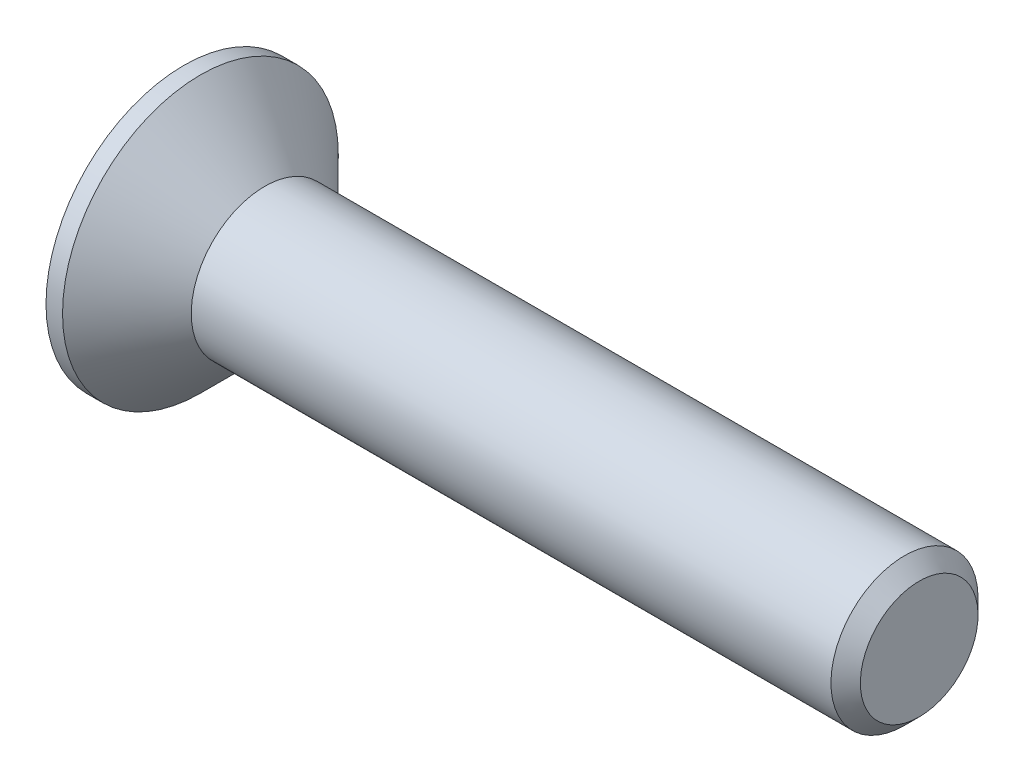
ISO-10303-21;
HEADER;
FILE_DESCRIPTION(('STEP AP214'),'2;1');
FILE_NAME('part.step','',(''),(''),'','','');
FILE_SCHEMA(('AUTOMOTIVE_DESIGN { 1 0 10303 214 1 1 1 1 }'));
ENDSEC;
DATA;
#1=APPLICATION_CONTEXT('core data for automotive mechanical design processes');
#2=APPLICATION_PROTOCOL_DEFINITION('international standard','automotive_design',2000,#1);
#3=PRODUCT_CONTEXT('',#1,'mechanical');
#4=PRODUCT('Part','Part','',(#3));
#5=PRODUCT_RELATED_PRODUCT_CATEGORY('part','',(#4));
#6=PRODUCT_DEFINITION_FORMATION('','',#4);
#7=PRODUCT_DEFINITION_CONTEXT('part definition',#1,'design');
#8=PRODUCT_DEFINITION('design','',#6,#7);
#9=PRODUCT_DEFINITION_SHAPE('','',#8);
#10=(LENGTH_UNIT() NAMED_UNIT(*) SI_UNIT(.MILLI.,.METRE.));
#11=(NAMED_UNIT(*) PLANE_ANGLE_UNIT() SI_UNIT($,.RADIAN.));
#12=(NAMED_UNIT(*) SI_UNIT($,.STERADIAN.) SOLID_ANGLE_UNIT());
#13=UNCERTAINTY_MEASURE_WITH_UNIT(LENGTH_MEASURE(1.E-05),#10,'distance_accuracy_value','');
#14=(GEOMETRIC_REPRESENTATION_CONTEXT(3) GLOBAL_UNCERTAINTY_ASSIGNED_CONTEXT((#13)) GLOBAL_UNIT_ASSIGNED_CONTEXT((#10,
#11,#12)) REPRESENTATION_CONTEXT('',''));
#15=CARTESIAN_POINT('',(0.,0.,0.));
#16=DIRECTION('',(0.,0.,1.));
#17=DIRECTION('',(1.,0.,0.));
#18=AXIS2_PLACEMENT_3D('',#15,#16,#17);
#19=CARTESIAN_POINT('',(0.,0.,0.));
#20=DIRECTION('',(-1.,0.,0.));
#21=DIRECTION('',(0.,-1.,0.));
#22=AXIS2_PLACEMENT_3D('',#19,#20,#21);
#23=CONICAL_SURFACE('',#22,2.,0.78539816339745);
#24=CARTESIAN_POINT('',(-1.74999999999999,0.,0.));
#25=DIRECTION('',(-1.,0.,0.));
#26=DIRECTION('',(0.,-1.,0.));
#27=AXIS2_PLACEMENT_3D('',#24,#25,#26);
#28=CIRCLE('',#27,3.75);
#29=CARTESIAN_POINT('',(-1.74999999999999,-3.75,0.));
#30=VERTEX_POINT('',#29);
#31=EDGE_CURVE('E189',#30,#30,#28,.T.);
#32=ORIENTED_EDGE('',*,*,#31,.F.);
#33=EDGE_LOOP('',(#32));
#34=FACE_BOUND('',#33,.T.);
#35=CARTESIAN_POINT('',(0.,0.,0.));
#36=DIRECTION('',(-1.,0.,0.));
#37=DIRECTION('',(0.,-1.,0.));
#38=AXIS2_PLACEMENT_3D('',#35,#36,#37);
#39=CIRCLE('',#38,2.);
#40=CARTESIAN_POINT('',(0.,-2.,0.));
#41=VERTEX_POINT('',#40);
#42=EDGE_CURVE('E212',#41,#41,#39,.T.);
#43=ORIENTED_EDGE('',*,*,#42,.T.);
#44=EDGE_LOOP('',(#43));
#45=FACE_BOUND('',#44,.T.);
#46=ADVANCED_FACE('F33',(#34,#45),#23,.T.);
#47=CARTESIAN_POINT('',(-2.2,0.,0.));
#48=DIRECTION('',(-1.,0.,0.));
#49=DIRECTION('',(0.,-1.,0.));
#50=AXIS2_PLACEMENT_3D('',#47,#48,#49);
#51=CYLINDRICAL_SURFACE('',#50,2.);
#52=CARTESIAN_POINT('',(17.4,0.,0.));
#53=DIRECTION('',(-1.,0.,0.));
#54=DIRECTION('',(0.,-1.,0.));
#55=AXIS2_PLACEMENT_3D('',#52,#53,#54);
#56=CIRCLE('',#55,2.);
#57=CARTESIAN_POINT('',(17.4,-2.,0.));
#58=VERTEX_POINT('',#57);
#59=EDGE_CURVE('E41',#58,#58,#56,.T.);
#60=ORIENTED_EDGE('',*,*,#59,.T.);
#61=EDGE_LOOP('',(#60));
#62=FACE_BOUND('',#61,.T.);
#63=ORIENTED_EDGE('',*,*,#42,.F.);
#64=EDGE_LOOP('',(#63));
#65=FACE_BOUND('',#64,.T.);
#66=ADVANCED_FACE('F217',(#62,#65),#51,.T.);
#67=CARTESIAN_POINT('',(17.8,0.,0.));
#68=DIRECTION('',(-1.,0.,0.));
#69=DIRECTION('',(0.,-1.,0.));
#70=AXIS2_PLACEMENT_3D('',#67,#68,#69);
#71=PLANE('',#70);
#72=CARTESIAN_POINT('',(17.8,0.,0.));
#73=DIRECTION('',(-1.,0.,0.));
#74=DIRECTION('',(0.,-1.,0.));
#75=AXIS2_PLACEMENT_3D('',#72,#73,#74);
#76=CIRCLE('',#75,1.59999999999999);
#77=CARTESIAN_POINT('',(17.8,-1.59999999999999,0.));
#78=VERTEX_POINT('',#77);
#79=EDGE_CURVE('E11',#78,#78,#76,.F.);
#80=ORIENTED_EDGE('',*,*,#79,.T.);
#81=EDGE_LOOP('',(#80));
#82=FACE_BOUND('',#81,.T.);
#83=ADVANCED_FACE('F239',(#82),#71,.F.);
#84=CARTESIAN_POINT('',(-2.2,3.75,0.));
#85=DIRECTION('',(1.,0.,0.));
#86=DIRECTION('',(0.,1.,0.));
#87=AXIS2_PLACEMENT_3D('',#84,#85,#86);
#88=PLANE('',#87);
#89=DIRECTION('',(0.,0.,-1.));
#90=VECTOR('',#89,1.);
#91=CARTESIAN_POINT('',(-2.2,0.55,-2.2));
#92=LINE('',#91,#90);
#93=CARTESIAN_POINT('',(-2.2,0.55,-0.55));
#94=VERTEX_POINT('',#93);
#95=CARTESIAN_POINT('',(-2.2,0.55,-2.2));
#96=VERTEX_POINT('',#95);
#97=EDGE_CURVE('E158',#94,#96,#92,.T.);
#98=ORIENTED_EDGE('',*,*,#97,.F.);
#99=DIRECTION('',(0.,-1.,0.));
#100=VECTOR('',#99,1.);
#101=CARTESIAN_POINT('',(-2.2,0.55,-0.55));
#102=LINE('',#101,#100);
#103=CARTESIAN_POINT('',(-2.2,2.2,-0.55));
#104=VERTEX_POINT('',#103);
#105=EDGE_CURVE('E48',#104,#94,#102,.T.);
#106=ORIENTED_EDGE('',*,*,#105,.F.);
#107=DIRECTION('',(0.,0.,-1.));
#108=VECTOR('',#107,1.);
#109=CARTESIAN_POINT('',(-2.2,2.2,-0.55));
#110=LINE('',#109,#108);
#111=CARTESIAN_POINT('',(-2.2,2.2,0.55));
#112=VERTEX_POINT('',#111);
#113=EDGE_CURVE('E185',#112,#104,#110,.T.);
#114=ORIENTED_EDGE('',*,*,#113,.F.);
#115=DIRECTION('',(0.,1.,0.));
#116=VECTOR('',#115,1.);
#117=CARTESIAN_POINT('',(-2.2,2.2,0.55));
#118=LINE('',#117,#116);
#119=CARTESIAN_POINT('',(-2.2,0.55,0.55));
#120=VERTEX_POINT('',#119);
#121=EDGE_CURVE('E183',#120,#112,#118,.T.);
#122=ORIENTED_EDGE('',*,*,#121,.F.);
#123=DIRECTION('',(0.,0.,-1.));
#124=VECTOR('',#123,1.);
#125=CARTESIAN_POINT('',(-2.2,0.55,0.55));
#126=LINE('',#125,#124);
#127=CARTESIAN_POINT('',(-2.2,0.55,2.2));
#128=VERTEX_POINT('',#127);
#129=EDGE_CURVE('E132',#128,#120,#126,.T.);
#130=ORIENTED_EDGE('',*,*,#129,.F.);
#131=DIRECTION('',(0.,1.,0.));
#132=VECTOR('',#131,1.);
#133=CARTESIAN_POINT('',(-2.2,0.55,2.2));
#134=LINE('',#133,#132);
#135=CARTESIAN_POINT('',(-2.2,-0.55,2.2));
#136=VERTEX_POINT('',#135);
#137=EDGE_CURVE('E179',#136,#128,#134,.T.);
#138=ORIENTED_EDGE('',*,*,#137,.F.);
#139=DIRECTION('',(0.,0.,1.));
#140=VECTOR('',#139,1.);
#141=CARTESIAN_POINT('',(-2.2,-0.55,2.2));
#142=LINE('',#141,#140);
#143=CARTESIAN_POINT('',(-2.2,-0.55,0.55));
#144=VERTEX_POINT('',#143);
#145=EDGE_CURVE('E176',#144,#136,#142,.T.);
#146=ORIENTED_EDGE('',*,*,#145,.F.);
#147=DIRECTION('',(0.,1.,0.));
#148=VECTOR('',#147,1.);
#149=CARTESIAN_POINT('',(-2.2,-0.55,0.55));
#150=LINE('',#149,#148);
#151=CARTESIAN_POINT('',(-2.2,-2.2,0.55));
#152=VERTEX_POINT('',#151);
#153=EDGE_CURVE('E173',#152,#144,#150,.T.);
#154=ORIENTED_EDGE('',*,*,#153,.F.);
#155=DIRECTION('',(0.,0.,1.));
#156=VECTOR('',#155,1.);
#157=CARTESIAN_POINT('',(-2.2,-2.2,0.55));
#158=LINE('',#157,#156);
#159=CARTESIAN_POINT('',(-2.2,-2.2,-0.55));
#160=VERTEX_POINT('',#159);
#161=EDGE_CURVE('E170',#160,#152,#158,.T.);
#162=ORIENTED_EDGE('',*,*,#161,.F.);
#163=DIRECTION('',(0.,-1.,0.));
#164=VECTOR('',#163,1.);
#165=CARTESIAN_POINT('',(-2.2,-2.2,-0.55));
#166=LINE('',#165,#164);
#167=CARTESIAN_POINT('',(-2.2,-0.55,-0.55));
#168=VERTEX_POINT('',#167);
#169=EDGE_CURVE('E167',#168,#160,#166,.T.);
#170=ORIENTED_EDGE('',*,*,#169,.F.);
#171=DIRECTION('',(0.,0.,1.));
#172=VECTOR('',#171,1.);
#173=CARTESIAN_POINT('',(-2.2,-0.55,-0.55));
#174=LINE('',#173,#172);
#175=CARTESIAN_POINT('',(-2.2,-0.55,-2.2));
#176=VERTEX_POINT('',#175);
#177=EDGE_CURVE('E164',#176,#168,#174,.T.);
#178=ORIENTED_EDGE('',*,*,#177,.F.);
#179=DIRECTION('',(0.,-1.,0.));
#180=VECTOR('',#179,1.);
#181=CARTESIAN_POINT('',(-2.2,-0.55,-2.2));
#182=LINE('',#181,#180);
#183=EDGE_CURVE('E161',#96,#176,#182,.T.);
#184=ORIENTED_EDGE('',*,*,#183,.F.);
#185=EDGE_LOOP('',(#98,#106,#114,#122,#130,#138,#146,#154,#162,#170,#178,#184));
#186=FACE_BOUND('',#185,.T.);
#187=CARTESIAN_POINT('',(-2.2,0.,0.));
#188=DIRECTION('',(-1.,0.,0.));
#189=DIRECTION('',(0.,-1.,0.));
#190=AXIS2_PLACEMENT_3D('',#187,#188,#189);
#191=CIRCLE('',#190,3.75);
#192=CARTESIAN_POINT('',(-2.2,-3.75,0.));
#193=VERTEX_POINT('',#192);
#194=EDGE_CURVE('E209',#193,#193,#191,.T.);
#195=ORIENTED_EDGE('',*,*,#194,.T.);
#196=EDGE_LOOP('',(#195));
#197=FACE_BOUND('',#196,.T.);
#198=ADVANCED_FACE('F230',(#186,#197),#88,.F.);
#199=CARTESIAN_POINT('',(-2.2,0.,0.));
#200=DIRECTION('',(-1.,0.,0.));
#201=DIRECTION('',(0.,-1.,0.));
#202=AXIS2_PLACEMENT_3D('',#199,#200,#201);
#203=CYLINDRICAL_SURFACE('',#202,3.75);
#204=ORIENTED_EDGE('',*,*,#194,.F.);
#205=EDGE_LOOP('',(#204));
#206=FACE_BOUND('',#205,.T.);
#207=ORIENTED_EDGE('',*,*,#31,.T.);
#208=EDGE_LOOP('',(#207));
#209=FACE_BOUND('',#208,.T.);
#210=ADVANCED_FACE('F222',(#206,#209),#203,.T.);
#211=CARTESIAN_POINT('',(17.4,0.,0.));
#212=DIRECTION('',(-1.,0.,0.));
#213=DIRECTION('',(0.,-1.,0.));
#214=AXIS2_PLACEMENT_3D('',#211,#212,#213);
#215=CONICAL_SURFACE('',#214,2.,0.785398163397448);
#216=ORIENTED_EDGE('',*,*,#79,.F.);
#217=EDGE_LOOP('',(#216));
#218=FACE_BOUND('',#217,.T.);
#219=ORIENTED_EDGE('',*,*,#59,.F.);
#220=EDGE_LOOP('',(#219));
#221=FACE_BOUND('',#220,.T.);
#222=ADVANCED_FACE('F35',(#218,#221),#215,.T.);
#223=CARTESIAN_POINT('',(-0.3,0.55,-0.55));
#224=DIRECTION('',(0.,0.,-1.));
#225=DIRECTION('',(-1.,0.,0.));
#226=AXIS2_PLACEMENT_3D('',#223,#224,#225);
#227=PLANE('',#226);
#228=ORIENTED_EDGE('',*,*,#105,.T.);
#229=DIRECTION('',(-1.,0.,0.));
#230=VECTOR('',#229,1.);
#231=CARTESIAN_POINT('',(-0.3,0.55,-0.55));
#232=LINE('',#231,#230);
#233=CARTESIAN_POINT('',(-0.3,0.55,-0.55));
#234=VERTEX_POINT('',#233);
#235=EDGE_CURVE('E96',#234,#94,#232,.T.);
#236=ORIENTED_EDGE('',*,*,#235,.F.);
#237=DIRECTION('',(0.,-1.,0.));
#238=VECTOR('',#237,1.);
#239=CARTESIAN_POINT('',(-0.3,0.55,-0.55));
#240=LINE('',#239,#238);
#241=CARTESIAN_POINT('',(-0.3,2.2,-0.55));
#242=VERTEX_POINT('',#241);
#243=EDGE_CURVE('E187',#242,#234,#240,.T.);
#244=ORIENTED_EDGE('',*,*,#243,.F.);
#245=DIRECTION('',(-1.,0.,0.));
#246=VECTOR('',#245,1.);
#247=CARTESIAN_POINT('',(-0.3,2.2,-0.55));
#248=LINE('',#247,#246);
#249=EDGE_CURVE('E56',#242,#104,#248,.T.);
#250=ORIENTED_EDGE('',*,*,#249,.T.);
#251=EDGE_LOOP('',(#228,#236,#244,#250));
#252=FACE_BOUND('',#251,.T.);
#253=ADVANCED_FACE('F221',(#252),#227,.F.);
#254=CARTESIAN_POINT('',(-0.3,2.2,-0.55));
#255=DIRECTION('',(0.,1.,0.));
#256=DIRECTION('',(-1.,0.,0.));
#257=AXIS2_PLACEMENT_3D('',#254,#255,#256);
#258=PLANE('',#257);
#259=ORIENTED_EDGE('',*,*,#113,.T.);
#260=ORIENTED_EDGE('',*,*,#249,.F.);
#261=DIRECTION('',(0.,0.,-1.));
#262=VECTOR('',#261,1.);
#263=CARTESIAN_POINT('',(-0.3,2.2,-0.55));
#264=LINE('',#263,#262);
#265=CARTESIAN_POINT('',(-0.3,2.2,0.55));
#266=VERTEX_POINT('',#265);
#267=EDGE_CURVE('E144',#266,#242,#264,.T.);
#268=ORIENTED_EDGE('',*,*,#267,.F.);
#269=DIRECTION('',(-1.,0.,0.));
#270=VECTOR('',#269,1.);
#271=CARTESIAN_POINT('',(-0.3,2.2,0.55));
#272=LINE('',#271,#270);
#273=EDGE_CURVE('E136',#266,#112,#272,.T.);
#274=ORIENTED_EDGE('',*,*,#273,.T.);
#275=EDGE_LOOP('',(#259,#260,#268,#274));
#276=FACE_BOUND('',#275,.T.);
#277=ADVANCED_FACE('F228',(#276),#258,.F.);
#278=CARTESIAN_POINT('',(-0.3,2.2,0.55));
#279=DIRECTION('',(0.,0.,1.));
#280=DIRECTION('',(1.,0.,0.));
#281=AXIS2_PLACEMENT_3D('',#278,#279,#280);
#282=PLANE('',#281);
#283=ORIENTED_EDGE('',*,*,#121,.T.);
#284=ORIENTED_EDGE('',*,*,#273,.F.);
#285=DIRECTION('',(0.,1.,0.));
#286=VECTOR('',#285,1.);
#287=CARTESIAN_POINT('',(-0.3,2.2,0.55));
#288=LINE('',#287,#286);
#289=CARTESIAN_POINT('',(-0.3,0.55,0.55));
#290=VERTEX_POINT('',#289);
#291=EDGE_CURVE('E140',#290,#266,#288,.T.);
#292=ORIENTED_EDGE('',*,*,#291,.F.);
#293=DIRECTION('',(-1.,0.,0.));
#294=VECTOR('',#293,1.);
#295=CARTESIAN_POINT('',(-0.3,0.55,0.55));
#296=LINE('',#295,#294);
#297=EDGE_CURVE('E125',#290,#120,#296,.T.);
#298=ORIENTED_EDGE('',*,*,#297,.T.);
#299=EDGE_LOOP('',(#283,#284,#292,#298));
#300=FACE_BOUND('',#299,.T.);
#301=ADVANCED_FACE('F141',(#300),#282,.F.);
#302=CARTESIAN_POINT('',(-0.3,0.55,0.55));
#303=DIRECTION('',(0.,1.,0.));
#304=DIRECTION('',(-1.,0.,0.));
#305=AXIS2_PLACEMENT_3D('',#302,#303,#304);
#306=PLANE('',#305);
#307=ORIENTED_EDGE('',*,*,#129,.T.);
#308=ORIENTED_EDGE('',*,*,#297,.F.);
#309=DIRECTION('',(0.,0.,-1.));
#310=VECTOR('',#309,1.);
#311=CARTESIAN_POINT('',(-0.3,0.55,0.55));
#312=LINE('',#311,#310);
#313=CARTESIAN_POINT('',(-0.3,0.55,2.2));
#314=VERTEX_POINT('',#313);
#315=EDGE_CURVE('E129',#314,#290,#312,.T.);
#316=ORIENTED_EDGE('',*,*,#315,.F.);
#317=DIRECTION('',(-1.,0.,0.));
#318=VECTOR('',#317,1.);
#319=CARTESIAN_POINT('',(-0.3,0.55,2.2));
#320=LINE('',#319,#318);
#321=EDGE_CURVE('E137',#314,#128,#320,.T.);
#322=ORIENTED_EDGE('',*,*,#321,.T.);
#323=EDGE_LOOP('',(#307,#308,#316,#322));
#324=FACE_BOUND('',#323,.T.);
#325=ADVANCED_FACE('F127',(#324),#306,.F.);
#326=CARTESIAN_POINT('',(-0.3,0.55,2.2));
#327=DIRECTION('',(0.,0.,1.));
#328=DIRECTION('',(1.,0.,0.));
#329=AXIS2_PLACEMENT_3D('',#326,#327,#328);
#330=PLANE('',#329);
#331=ORIENTED_EDGE('',*,*,#137,.T.);
#332=ORIENTED_EDGE('',*,*,#321,.F.);
#333=DIRECTION('',(0.,1.,0.));
#334=VECTOR('',#333,1.);
#335=CARTESIAN_POINT('',(-0.3,0.55,2.2));
#336=LINE('',#335,#334);
#337=CARTESIAN_POINT('',(-0.3,-0.55,2.2));
#338=VERTEX_POINT('',#337);
#339=EDGE_CURVE('E150',#338,#314,#336,.T.);
#340=ORIENTED_EDGE('',*,*,#339,.F.);
#341=DIRECTION('',(-1.,0.,0.));
#342=VECTOR('',#341,1.);
#343=CARTESIAN_POINT('',(-0.3,-0.55,2.2));
#344=LINE('',#343,#342);
#345=EDGE_CURVE('E192',#338,#136,#344,.T.);
#346=ORIENTED_EDGE('',*,*,#345,.T.);
#347=EDGE_LOOP('',(#331,#332,#340,#346));
#348=FACE_BOUND('',#347,.T.);
#349=ADVANCED_FACE('F277',(#348),#330,.F.);
#350=CARTESIAN_POINT('',(-0.3,-0.55,2.2));
#351=DIRECTION('',(0.,-1.,0.));
#352=DIRECTION('',(1.,0.,0.));
#353=AXIS2_PLACEMENT_3D('',#350,#351,#352);
#354=PLANE('',#353);
#355=ORIENTED_EDGE('',*,*,#145,.T.);
#356=ORIENTED_EDGE('',*,*,#345,.F.);
#357=DIRECTION('',(0.,0.,1.));
#358=VECTOR('',#357,1.);
#359=CARTESIAN_POINT('',(-0.3,-0.55,2.2));
#360=LINE('',#359,#358);
#361=CARTESIAN_POINT('',(-0.3,-0.55,0.55));
#362=VERTEX_POINT('',#361);
#363=EDGE_CURVE('E152',#362,#338,#360,.T.);
#364=ORIENTED_EDGE('',*,*,#363,.F.);
#365=DIRECTION('',(-1.,0.,0.));
#366=VECTOR('',#365,1.);
#367=CARTESIAN_POINT('',(-0.3,-0.55,0.55));
#368=LINE('',#367,#366);
#369=EDGE_CURVE('E194',#362,#144,#368,.T.);
#370=ORIENTED_EDGE('',*,*,#369,.T.);
#371=EDGE_LOOP('',(#355,#356,#364,#370));
#372=FACE_BOUND('',#371,.T.);
#373=ADVANCED_FACE('F273',(#372),#354,.F.);
#374=CARTESIAN_POINT('',(-0.3,-0.55,0.55));
#375=DIRECTION('',(0.,0.,1.));
#376=DIRECTION('',(1.,0.,0.));
#377=AXIS2_PLACEMENT_3D('',#374,#375,#376);
#378=PLANE('',#377);
#379=ORIENTED_EDGE('',*,*,#153,.T.);
#380=ORIENTED_EDGE('',*,*,#369,.F.);
#381=DIRECTION('',(0.,1.,0.));
#382=VECTOR('',#381,1.);
#383=CARTESIAN_POINT('',(-0.3,-0.55,0.55));
#384=LINE('',#383,#382);
#385=CARTESIAN_POINT('',(-0.3,-2.2,0.55));
#386=VERTEX_POINT('',#385);
#387=EDGE_CURVE('E422',#386,#362,#384,.T.);
#388=ORIENTED_EDGE('',*,*,#387,.F.);
#389=DIRECTION('',(-1.,0.,0.));
#390=VECTOR('',#389,1.);
#391=CARTESIAN_POINT('',(-0.3,-2.2,0.55));
#392=LINE('',#391,#390);
#393=EDGE_CURVE('E196',#386,#152,#392,.T.);
#394=ORIENTED_EDGE('',*,*,#393,.T.);
#395=EDGE_LOOP('',(#379,#380,#388,#394));
#396=FACE_BOUND('',#395,.T.);
#397=ADVANCED_FACE('F269',(#396),#378,.F.);
#398=CARTESIAN_POINT('',(-0.3,-2.2,0.55));
#399=DIRECTION('',(0.,-1.,0.));
#400=DIRECTION('',(1.,0.,0.));
#401=AXIS2_PLACEMENT_3D('',#398,#399,#400);
#402=PLANE('',#401);
#403=ORIENTED_EDGE('',*,*,#161,.T.);
#404=ORIENTED_EDGE('',*,*,#393,.F.);
#405=DIRECTION('',(0.,0.,1.));
#406=VECTOR('',#405,1.);
#407=CARTESIAN_POINT('',(-0.3,-2.2,0.55));
#408=LINE('',#407,#406);
#409=CARTESIAN_POINT('',(-0.3,-2.2,-0.55));
#410=VERTEX_POINT('',#409);
#411=EDGE_CURVE('E419',#410,#386,#408,.T.);
#412=ORIENTED_EDGE('',*,*,#411,.F.);
#413=DIRECTION('',(-1.,0.,0.));
#414=VECTOR('',#413,1.);
#415=CARTESIAN_POINT('',(-0.3,-2.2,-0.55));
#416=LINE('',#415,#414);
#417=EDGE_CURVE('E198',#410,#160,#416,.T.);
#418=ORIENTED_EDGE('',*,*,#417,.T.);
#419=EDGE_LOOP('',(#403,#404,#412,#418));
#420=FACE_BOUND('',#419,.T.);
#421=ADVANCED_FACE('F265',(#420),#402,.F.);
#422=CARTESIAN_POINT('',(-0.3,-2.2,-0.55));
#423=DIRECTION('',(0.,0.,-1.));
#424=DIRECTION('',(-1.,0.,0.));
#425=AXIS2_PLACEMENT_3D('',#422,#423,#424);
#426=PLANE('',#425);
#427=ORIENTED_EDGE('',*,*,#169,.T.);
#428=ORIENTED_EDGE('',*,*,#417,.F.);
#429=DIRECTION('',(0.,-1.,0.));
#430=VECTOR('',#429,1.);
#431=CARTESIAN_POINT('',(-0.3,-2.2,-0.55));
#432=LINE('',#431,#430);
#433=CARTESIAN_POINT('',(-0.3,-0.55,-0.55));
#434=VERTEX_POINT('',#433);
#435=EDGE_CURVE('E416',#434,#410,#432,.T.);
#436=ORIENTED_EDGE('',*,*,#435,.F.);
#437=DIRECTION('',(-1.,0.,0.));
#438=VECTOR('',#437,1.);
#439=CARTESIAN_POINT('',(-0.3,-0.55,-0.55));
#440=LINE('',#439,#438);
#441=EDGE_CURVE('E200',#434,#168,#440,.T.);
#442=ORIENTED_EDGE('',*,*,#441,.T.);
#443=EDGE_LOOP('',(#427,#428,#436,#442));
#444=FACE_BOUND('',#443,.T.);
#445=ADVANCED_FACE('F261',(#444),#426,.F.);
#446=CARTESIAN_POINT('',(-0.3,-0.55,-0.55));
#447=DIRECTION('',(0.,-1.,0.));
#448=DIRECTION('',(1.,0.,0.));
#449=AXIS2_PLACEMENT_3D('',#446,#447,#448);
#450=PLANE('',#449);
#451=ORIENTED_EDGE('',*,*,#177,.T.);
#452=ORIENTED_EDGE('',*,*,#441,.F.);
#453=DIRECTION('',(0.,0.,1.));
#454=VECTOR('',#453,1.);
#455=CARTESIAN_POINT('',(-0.3,-0.55,-0.55));
#456=LINE('',#455,#454);
#457=CARTESIAN_POINT('',(-0.3,-0.55,-2.2));
#458=VERTEX_POINT('',#457);
#459=EDGE_CURVE('E413',#458,#434,#456,.T.);
#460=ORIENTED_EDGE('',*,*,#459,.F.);
#461=DIRECTION('',(-1.,0.,0.));
#462=VECTOR('',#461,1.);
#463=CARTESIAN_POINT('',(-0.3,-0.55,-2.2));
#464=LINE('',#463,#462);
#465=EDGE_CURVE('E202',#458,#176,#464,.T.);
#466=ORIENTED_EDGE('',*,*,#465,.T.);
#467=EDGE_LOOP('',(#451,#452,#460,#466));
#468=FACE_BOUND('',#467,.T.);
#469=ADVANCED_FACE('F257',(#468),#450,.F.);
#470=CARTESIAN_POINT('',(-0.3,-0.55,-2.2));
#471=DIRECTION('',(0.,0.,-1.));
#472=DIRECTION('',(-1.,0.,0.));
#473=AXIS2_PLACEMENT_3D('',#470,#471,#472);
#474=PLANE('',#473);
#475=ORIENTED_EDGE('',*,*,#183,.T.);
#476=ORIENTED_EDGE('',*,*,#465,.F.);
#477=DIRECTION('',(0.,-1.,0.));
#478=VECTOR('',#477,1.);
#479=CARTESIAN_POINT('',(-0.3,-0.55,-2.2));
#480=LINE('',#479,#478);
#481=CARTESIAN_POINT('',(-0.3,0.55,-2.2));
#482=VERTEX_POINT('',#481);
#483=EDGE_CURVE('E408',#482,#458,#480,.T.);
#484=ORIENTED_EDGE('',*,*,#483,.F.);
#485=DIRECTION('',(-1.,0.,0.));
#486=VECTOR('',#485,1.);
#487=CARTESIAN_POINT('',(-0.3,0.55,-2.2));
#488=LINE('',#487,#486);
#489=EDGE_CURVE('E204',#482,#96,#488,.T.);
#490=ORIENTED_EDGE('',*,*,#489,.T.);
#491=EDGE_LOOP('',(#475,#476,#484,#490));
#492=FACE_BOUND('',#491,.T.);
#493=ADVANCED_FACE('F253',(#492),#474,.F.);
#494=CARTESIAN_POINT('',(-0.3,0.55,-2.2));
#495=DIRECTION('',(0.,1.,0.));
#496=DIRECTION('',(-1.,0.,0.));
#497=AXIS2_PLACEMENT_3D('',#494,#495,#496);
#498=PLANE('',#497);
#499=ORIENTED_EDGE('',*,*,#97,.T.);
#500=ORIENTED_EDGE('',*,*,#489,.F.);
#501=DIRECTION('',(0.,0.,-1.));
#502=VECTOR('',#501,1.);
#503=CARTESIAN_POINT('',(-0.3,0.55,-2.2));
#504=LINE('',#503,#502);
#505=EDGE_CURVE('E406',#234,#482,#504,.T.);
#506=ORIENTED_EDGE('',*,*,#505,.F.);
#507=ORIENTED_EDGE('',*,*,#235,.T.);
#508=EDGE_LOOP('',(#499,#500,#506,#507));
#509=FACE_BOUND('',#508,.T.);
#510=ADVANCED_FACE('F250',(#509),#498,.F.);
#511=CARTESIAN_POINT('',(-0.3,0.,0.));
#512=DIRECTION('',(1.,0.,0.));
#513=DIRECTION('',(0.,0.,-1.));
#514=AXIS2_PLACEMENT_3D('',#511,#512,#513);
#515=PLANE('',#514);
#516=ORIENTED_EDGE('',*,*,#243,.T.);
#517=ORIENTED_EDGE('',*,*,#505,.T.);
#518=ORIENTED_EDGE('',*,*,#483,.T.);
#519=ORIENTED_EDGE('',*,*,#459,.T.);
#520=ORIENTED_EDGE('',*,*,#435,.T.);
#521=ORIENTED_EDGE('',*,*,#411,.T.);
#522=ORIENTED_EDGE('',*,*,#387,.T.);
#523=ORIENTED_EDGE('',*,*,#363,.T.);
#524=ORIENTED_EDGE('',*,*,#339,.T.);
#525=ORIENTED_EDGE('',*,*,#315,.T.);
#526=ORIENTED_EDGE('',*,*,#291,.T.);
#527=ORIENTED_EDGE('',*,*,#267,.T.);
#528=EDGE_LOOP('',(#516,#517,#518,#519,#520,#521,#522,#523,#524,#525,#526,#527));
#529=FACE_BOUND('',#528,.T.);
#530=ADVANCED_FACE('F147',(#529),#515,.F.);
#531=CLOSED_SHELL('',(#46,#66,#83,#198,#210,#222,#253,#277,#301,#325,#349,#373,#397,#421,#445,
#469,#493,#510,#530));
#532=MANIFOLD_SOLID_BREP('B2',#531);
#533=ADVANCED_BREP_SHAPE_REPRESENTATION('',(#18,#532),#14);
#534=SHAPE_DEFINITION_REPRESENTATION(#9,#533);
ENDSEC;
END-ISO-10303-21;
